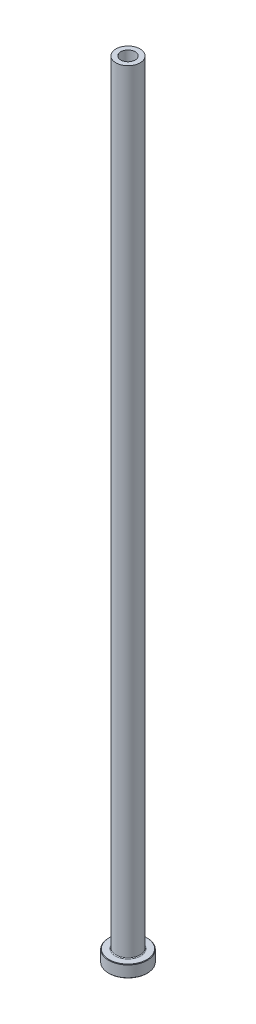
ISO-10303-21;
HEADER;
FILE_DESCRIPTION(('STEP AP214'),'2;1');
FILE_NAME('part.step','',(''),(''),'','','');
FILE_SCHEMA(('AUTOMOTIVE_DESIGN { 1 0 10303 214 1 1 1 1 }'));
ENDSEC;
DATA;
#1=APPLICATION_CONTEXT('core data for automotive mechanical design processes');
#2=APPLICATION_PROTOCOL_DEFINITION('international standard','automotive_design',2000,#1);
#3=PRODUCT_CONTEXT('',#1,'mechanical');
#4=PRODUCT('Part','Part','',(#3));
#5=PRODUCT_RELATED_PRODUCT_CATEGORY('part','',(#4));
#6=PRODUCT_DEFINITION_FORMATION('','',#4);
#7=PRODUCT_DEFINITION_CONTEXT('part definition',#1,'design');
#8=PRODUCT_DEFINITION('design','',#6,#7);
#9=PRODUCT_DEFINITION_SHAPE('','',#8);
#10=(LENGTH_UNIT() NAMED_UNIT(*) SI_UNIT(.MILLI.,.METRE.));
#11=(NAMED_UNIT(*) PLANE_ANGLE_UNIT() SI_UNIT($,.RADIAN.));
#12=(NAMED_UNIT(*) SI_UNIT($,.STERADIAN.) SOLID_ANGLE_UNIT());
#13=UNCERTAINTY_MEASURE_WITH_UNIT(LENGTH_MEASURE(1.E-05),#10,'distance_accuracy_value','');
#14=(GEOMETRIC_REPRESENTATION_CONTEXT(3) GLOBAL_UNCERTAINTY_ASSIGNED_CONTEXT((#13)) GLOBAL_UNIT_ASSIGNED_CONTEXT((#10,
#11,#12)) REPRESENTATION_CONTEXT('',''));
#15=CARTESIAN_POINT('',(0.,0.,0.));
#16=DIRECTION('',(0.,0.,1.));
#17=DIRECTION('',(1.,0.,0.));
#18=AXIS2_PLACEMENT_3D('',#15,#16,#17);
#19=CARTESIAN_POINT('',(0.,92.1876809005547,0.));
#20=DIRECTION('',(0.,1.,0.));
#21=DIRECTION('',(0.,0.,1.));
#22=AXIS2_PLACEMENT_3D('',#19,#20,#21);
#23=CYLINDRICAL_SURFACE('',#22,3.00000000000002);
#24=CARTESIAN_POINT('',(0.,325.,0.));
#25=DIRECTION('',(0.,1.,0.));
#26=DIRECTION('',(0.,0.,1.));
#27=AXIS2_PLACEMENT_3D('',#24,#25,#26);
#28=CIRCLE('',#27,3.00000000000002);
#29=CARTESIAN_POINT('',(0.,325.,3.00000000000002));
#30=VERTEX_POINT('',#29);
#31=EDGE_CURVE('E62',#30,#30,#28,.T.);
#32=ORIENTED_EDGE('',*,*,#31,.T.);
#33=EDGE_LOOP('',(#32));
#34=FACE_BOUND('',#33,.T.);
#35=CARTESIAN_POINT('',(0.,280.,0.));
#36=DIRECTION('',(0.,1.,0.));
#37=DIRECTION('',(0.,0.,1.));
#38=AXIS2_PLACEMENT_3D('',#35,#36,#37);
#39=CIRCLE('',#38,3.00000000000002);
#40=CARTESIAN_POINT('',(0.,280.,3.00000000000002));
#41=VERTEX_POINT('',#40);
#42=EDGE_CURVE('E71',#41,#41,#39,.T.);
#43=ORIENTED_EDGE('',*,*,#42,.F.);
#44=EDGE_LOOP('',(#43));
#45=FACE_BOUND('',#44,.T.);
#46=ADVANCED_FACE('F30',(#34,#45),#23,.F.);
#47=CARTESIAN_POINT('',(-3.00000000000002,325.,0.));
#48=DIRECTION('',(0.,1.,0.));
#49=DIRECTION('',(0.,0.,1.));
#50=AXIS2_PLACEMENT_3D('',#47,#48,#49);
#51=PLANE('',#50);
#52=CARTESIAN_POINT('',(0.,325.,0.));
#53=DIRECTION('',(0.,1.,0.));
#54=DIRECTION('',(0.,0.,1.));
#55=AXIS2_PLACEMENT_3D('',#52,#53,#54);
#56=CIRCLE('',#55,5.00000000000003);
#57=CARTESIAN_POINT('',(0.,325.,5.00000000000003));
#58=VERTEX_POINT('',#57);
#59=EDGE_CURVE('E65',#58,#58,#56,.T.);
#60=ORIENTED_EDGE('',*,*,#59,.T.);
#61=EDGE_LOOP('',(#60));
#62=FACE_BOUND('',#61,.T.);
#63=ORIENTED_EDGE('',*,*,#31,.F.);
#64=EDGE_LOOP('',(#63));
#65=FACE_BOUND('',#64,.T.);
#66=ADVANCED_FACE('F79',(#62,#65),#51,.T.);
#67=CARTESIAN_POINT('',(0.,92.1876809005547,0.));
#68=DIRECTION('',(0.,1.,0.));
#69=DIRECTION('',(0.,0.,1.));
#70=AXIS2_PLACEMENT_3D('',#67,#68,#69);
#71=CYLINDRICAL_SURFACE('',#70,5.00000000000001);
#72=CARTESIAN_POINT('',(0.,5.3,0.));
#73=DIRECTION('',(0.,1.,0.));
#74=DIRECTION('',(0.,0.,1.));
#75=AXIS2_PLACEMENT_3D('',#72,#73,#74);
#76=CIRCLE('',#75,5.00000000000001);
#77=CARTESIAN_POINT('',(0.,5.3,5.00000000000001));
#78=VERTEX_POINT('',#77);
#79=EDGE_CURVE('E59',#78,#78,#76,.T.);
#80=ORIENTED_EDGE('',*,*,#79,.T.);
#81=EDGE_LOOP('',(#80));
#82=FACE_BOUND('',#81,.T.);
#83=ORIENTED_EDGE('',*,*,#59,.F.);
#84=EDGE_LOOP('',(#83));
#85=FACE_BOUND('',#84,.T.);
#86=ADVANCED_FACE('F85',(#82,#85),#71,.T.);
#87=CARTESIAN_POINT('',(-4.99999999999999,5.,0.));
#88=DIRECTION('',(0.,1.,0.));
#89=DIRECTION('',(0.,0.,1.));
#90=AXIS2_PLACEMENT_3D('',#87,#88,#89);
#91=PLANE('',#90);
#92=CARTESIAN_POINT('',(0.,5.,0.));
#93=DIRECTION('',(0.,1.,0.));
#94=DIRECTION('',(0.,0.,1.));
#95=AXIS2_PLACEMENT_3D('',#92,#93,#94);
#96=CIRCLE('',#95,7.79999999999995);
#97=CARTESIAN_POINT('',(0.,5.,7.79999999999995));
#98=VERTEX_POINT('',#97);
#99=EDGE_CURVE('E53',#98,#98,#96,.T.);
#100=ORIENTED_EDGE('',*,*,#99,.T.);
#101=EDGE_LOOP('',(#100));
#102=FACE_BOUND('',#101,.T.);
#103=CARTESIAN_POINT('',(0.,5.,0.));
#104=DIRECTION('',(0.,1.,0.));
#105=DIRECTION('',(0.,0.,1.));
#106=AXIS2_PLACEMENT_3D('',#103,#104,#105);
#107=CIRCLE('',#106,5.30000000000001);
#108=CARTESIAN_POINT('',(0.,5.,5.30000000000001));
#109=VERTEX_POINT('',#108);
#110=EDGE_CURVE('E56',#109,#109,#107,.F.);
#111=ORIENTED_EDGE('',*,*,#110,.T.);
#112=EDGE_LOOP('',(#111));
#113=FACE_BOUND('',#112,.T.);
#114=ADVANCED_FACE('F111',(#102,#113),#91,.T.);
#115=CARTESIAN_POINT('',(0.,92.1876809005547,0.));
#116=DIRECTION('',(0.,1.,0.));
#117=DIRECTION('',(0.,0.,1.));
#118=AXIS2_PLACEMENT_3D('',#115,#116,#117);
#119=CYLINDRICAL_SURFACE('',#118,7.99999999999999);
#120=CARTESIAN_POINT('',(0.,4.79999999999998,0.));
#121=DIRECTION('',(0.,1.,0.));
#122=DIRECTION('',(0.,0.,1.));
#123=AXIS2_PLACEMENT_3D('',#120,#121,#122);
#124=CIRCLE('',#123,7.99999999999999);
#125=CARTESIAN_POINT('',(0.,4.79999999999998,7.99999999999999));
#126=VERTEX_POINT('',#125);
#127=EDGE_CURVE('E45',#126,#126,#124,.F.);
#128=ORIENTED_EDGE('',*,*,#127,.T.);
#129=EDGE_LOOP('',(#128));
#130=FACE_BOUND('',#129,.T.);
#131=CARTESIAN_POINT('',(0.,0.199999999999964,0.));
#132=DIRECTION('',(0.,-1.,0.));
#133=DIRECTION('',(0.,0.,-1.));
#134=AXIS2_PLACEMENT_3D('',#131,#132,#133);
#135=CIRCLE('',#134,7.99999999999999);
#136=CARTESIAN_POINT('',(0.,0.199999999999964,-7.99999999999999));
#137=VERTEX_POINT('',#136);
#138=EDGE_CURVE('E50',#137,#137,#135,.F.);
#139=ORIENTED_EDGE('',*,*,#138,.T.);
#140=EDGE_LOOP('',(#139));
#141=FACE_BOUND('',#140,.T.);
#142=ADVANCED_FACE('F108',(#130,#141),#119,.T.);
#143=CARTESIAN_POINT('',(-7.99999999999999,0.,0.));
#144=DIRECTION('',(0.,-1.,0.));
#145=DIRECTION('',(0.,0.,-1.));
#146=AXIS2_PLACEMENT_3D('',#143,#144,#145);
#147=PLANE('',#146);
#148=CARTESIAN_POINT('',(0.,0.,0.));
#149=DIRECTION('',(0.,-1.,0.));
#150=DIRECTION('',(0.,0.,-1.));
#151=AXIS2_PLACEMENT_3D('',#148,#149,#150);
#152=CIRCLE('',#151,3.75);
#153=CARTESIAN_POINT('',(0.,0.,-3.75));
#154=VERTEX_POINT('',#153);
#155=EDGE_CURVE('E37',#154,#154,#152,.F.);
#156=ORIENTED_EDGE('',*,*,#155,.T.);
#157=EDGE_LOOP('',(#156));
#158=FACE_BOUND('',#157,.T.);
#159=CARTESIAN_POINT('',(0.,0.,0.));
#160=DIRECTION('',(0.,-1.,0.));
#161=DIRECTION('',(0.,0.,-1.));
#162=AXIS2_PLACEMENT_3D('',#159,#160,#161);
#163=CIRCLE('',#162,7.8);
#164=CARTESIAN_POINT('',(0.,0.,-7.8));
#165=VERTEX_POINT('',#164);
#166=EDGE_CURVE('E41',#165,#165,#163,.T.);
#167=ORIENTED_EDGE('',*,*,#166,.T.);
#168=EDGE_LOOP('',(#167));
#169=FACE_BOUND('',#168,.T.);
#170=ADVANCED_FACE('F110',(#158,#169),#147,.T.);
#171=CARTESIAN_POINT('',(0.,92.1876809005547,0.));
#172=DIRECTION('',(0.,1.,0.));
#173=DIRECTION('',(0.,0.,1.));
#174=AXIS2_PLACEMENT_3D('',#171,#172,#173);
#175=CYLINDRICAL_SURFACE('',#174,3.25000000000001);
#176=CARTESIAN_POINT('',(0.,0.499999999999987,0.));
#177=DIRECTION('',(0.,-1.,0.));
#178=DIRECTION('',(0.,0.,-1.));
#179=AXIS2_PLACEMENT_3D('',#176,#177,#178);
#180=CIRCLE('',#179,3.25000000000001);
#181=CARTESIAN_POINT('',(0.,0.499999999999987,-3.25000000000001));
#182=VERTEX_POINT('',#181);
#183=EDGE_CURVE('E10',#182,#182,#180,.T.);
#184=ORIENTED_EDGE('',*,*,#183,.T.);
#185=EDGE_LOOP('',(#184));
#186=FACE_BOUND('',#185,.T.);
#187=CARTESIAN_POINT('',(0.,268.,0.));
#188=DIRECTION('',(0.,1.,0.));
#189=DIRECTION('',(0.,0.,1.));
#190=AXIS2_PLACEMENT_3D('',#187,#188,#189);
#191=CIRCLE('',#190,3.25000000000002);
#192=CARTESIAN_POINT('',(0.,268.,3.25000000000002));
#193=VERTEX_POINT('',#192);
#194=EDGE_CURVE('E68',#193,#193,#191,.T.);
#195=ORIENTED_EDGE('',*,*,#194,.T.);
#196=EDGE_LOOP('',(#195));
#197=FACE_BOUND('',#196,.T.);
#198=ADVANCED_FACE('F118',(#186,#197),#175,.F.);
#199=CARTESIAN_POINT('',(0.,268.,0.));
#200=DIRECTION('',(0.,-1.,0.));
#201=DIRECTION('',(0.,0.,-1.));
#202=AXIS2_PLACEMENT_3D('',#199,#200,#201);
#203=CONICAL_SURFACE('',#202,3.25000000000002,0.0208303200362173);
#204=ORIENTED_EDGE('',*,*,#42,.T.);
#205=EDGE_LOOP('',(#204));
#206=FACE_BOUND('',#205,.T.);
#207=ORIENTED_EDGE('',*,*,#194,.F.);
#208=EDGE_LOOP('',(#207));
#209=FACE_BOUND('',#208,.T.);
#210=ADVANCED_FACE('F75',(#206,#209),#203,.F.);
#211=CARTESIAN_POINT('',(0.,5.3,0.));
#212=DIRECTION('',(0.,1.,0.));
#213=DIRECTION('',(0.,0.,1.));
#214=AXIS2_PLACEMENT_3D('',#211,#212,#213);
#215=TOROIDAL_SURFACE('',#214,5.30000000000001,0.3);
#216=ORIENTED_EDGE('',*,*,#110,.F.);
#217=EDGE_LOOP('',(#216));
#218=FACE_BOUND('',#217,.T.);
#219=ORIENTED_EDGE('',*,*,#79,.F.);
#220=EDGE_LOOP('',(#219));
#221=FACE_BOUND('',#220,.T.);
#222=ADVANCED_FACE('F90',(#218,#221),#215,.F.);
#223=CARTESIAN_POINT('',(0.,5.,0.));
#224=DIRECTION('',(0.,-1.,0.));
#225=DIRECTION('',(0.,0.,-1.));
#226=AXIS2_PLACEMENT_3D('',#223,#224,#225);
#227=CONICAL_SURFACE('',#226,7.79999999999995,0.785398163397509);
#228=ORIENTED_EDGE('',*,*,#127,.F.);
#229=EDGE_LOOP('',(#228));
#230=FACE_BOUND('',#229,.T.);
#231=ORIENTED_EDGE('',*,*,#99,.F.);
#232=EDGE_LOOP('',(#231));
#233=FACE_BOUND('',#232,.T.);
#234=ADVANCED_FACE('F93',(#230,#233),#227,.T.);
#235=CARTESIAN_POINT('',(0.,0.199999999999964,0.));
#236=DIRECTION('',(0.,1.,0.));
#237=DIRECTION('',(0.,0.,1.));
#238=AXIS2_PLACEMENT_3D('',#235,#236,#237);
#239=CONICAL_SURFACE('',#238,7.99999999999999,0.785398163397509);
#240=ORIENTED_EDGE('',*,*,#166,.F.);
#241=EDGE_LOOP('',(#240));
#242=FACE_BOUND('',#241,.T.);
#243=ORIENTED_EDGE('',*,*,#138,.F.);
#244=EDGE_LOOP('',(#243));
#245=FACE_BOUND('',#244,.T.);
#246=ADVANCED_FACE('F96',(#242,#245),#239,.T.);
#247=CARTESIAN_POINT('',(0.,0.,0.));
#248=DIRECTION('',(0.,-1.,0.));
#249=DIRECTION('',(0.,0.,-1.));
#250=AXIS2_PLACEMENT_3D('',#247,#248,#249);
#251=CONICAL_SURFACE('',#250,3.75,0.785398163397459);
#252=ORIENTED_EDGE('',*,*,#183,.F.);
#253=EDGE_LOOP('',(#252));
#254=FACE_BOUND('',#253,.T.);
#255=ORIENTED_EDGE('',*,*,#155,.F.);
#256=EDGE_LOOP('',(#255));
#257=FACE_BOUND('',#256,.T.);
#258=ADVANCED_FACE('F32',(#254,#257),#251,.F.);
#259=CLOSED_SHELL('',(#46,#66,#86,#114,#142,#170,#198,#210,#222,#234,#246,#258));
#260=MANIFOLD_SOLID_BREP('B2',#259);
#261=ADVANCED_BREP_SHAPE_REPRESENTATION('',(#18,#260),#14);
#262=SHAPE_DEFINITION_REPRESENTATION(#9,#261);
ENDSEC;
END-ISO-10303-21;
